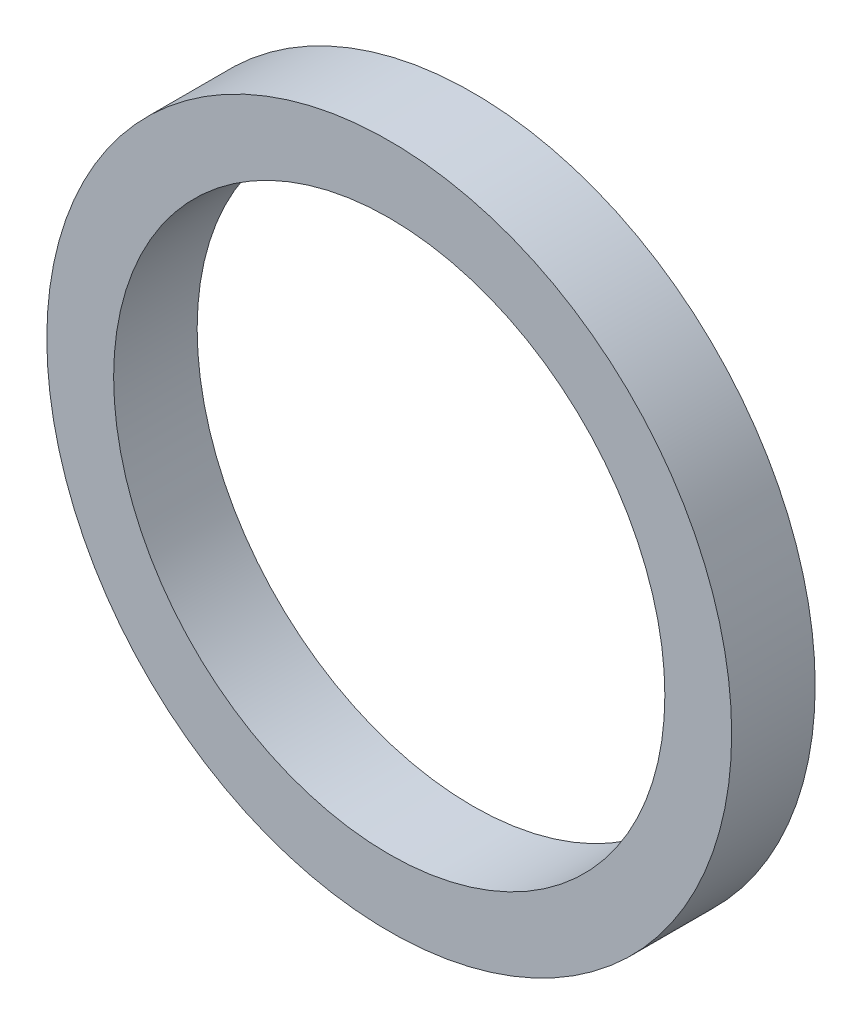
ISO-10303-21;
HEADER;
FILE_DESCRIPTION(('STEP AP214'),'2;1');
FILE_NAME('part.step','',(''),(''),'','','');
FILE_SCHEMA(('AUTOMOTIVE_DESIGN { 1 0 10303 214 1 1 1 1 }'));
ENDSEC;
DATA;
#1=APPLICATION_CONTEXT('core data for automotive mechanical design processes');
#2=APPLICATION_PROTOCOL_DEFINITION('international standard','automotive_design',2000,#1);
#3=PRODUCT_CONTEXT('',#1,'mechanical');
#4=PRODUCT('Part','Part','',(#3));
#5=PRODUCT_RELATED_PRODUCT_CATEGORY('part','',(#4));
#6=PRODUCT_DEFINITION_FORMATION('','',#4);
#7=PRODUCT_DEFINITION_CONTEXT('part definition',#1,'design');
#8=PRODUCT_DEFINITION('design','',#6,#7);
#9=PRODUCT_DEFINITION_SHAPE('','',#8);
#10=(LENGTH_UNIT() NAMED_UNIT(*) SI_UNIT(.MILLI.,.METRE.));
#11=(NAMED_UNIT(*) PLANE_ANGLE_UNIT() SI_UNIT($,.RADIAN.));
#12=(NAMED_UNIT(*) SI_UNIT($,.STERADIAN.) SOLID_ANGLE_UNIT());
#13=UNCERTAINTY_MEASURE_WITH_UNIT(LENGTH_MEASURE(1.E-05),#10,'distance_accuracy_value','');
#14=(GEOMETRIC_REPRESENTATION_CONTEXT(3) GLOBAL_UNCERTAINTY_ASSIGNED_CONTEXT((#13)) GLOBAL_UNIT_ASSIGNED_CONTEXT((#10,
#11,#12)) REPRESENTATION_CONTEXT('',''));
#15=CARTESIAN_POINT('',(0.,0.,0.));
#16=DIRECTION('',(0.,0.,1.));
#17=DIRECTION('',(1.,0.,0.));
#18=AXIS2_PLACEMENT_3D('',#15,#16,#17);
#19=CARTESIAN_POINT('',(0.,0.,2.5));
#20=DIRECTION('',(0.,0.,1.));
#21=DIRECTION('',(1.,0.,0.));
#22=AXIS2_PLACEMENT_3D('',#19,#20,#21);
#23=PLANE('',#22);
#24=CARTESIAN_POINT('',(0.,0.,2.5));
#25=DIRECTION('',(0.,0.,1.));
#26=DIRECTION('',(1.,0.,0.));
#27=AXIS2_PLACEMENT_3D('',#24,#25,#26);
#28=CIRCLE('',#27,10.25);
#29=CARTESIAN_POINT('',(10.25,0.,2.5));
#30=VERTEX_POINT('',#29);
#31=EDGE_CURVE('E10',#30,#30,#28,.T.);
#32=ORIENTED_EDGE('',*,*,#31,.T.);
#33=EDGE_LOOP('',(#32));
#34=FACE_BOUND('',#33,.T.);
#35=CARTESIAN_POINT('',(0.,0.,2.5));
#36=DIRECTION('',(0.,0.,1.));
#37=DIRECTION('',(1.,0.,0.));
#38=AXIS2_PLACEMENT_3D('',#35,#36,#37);
#39=CIRCLE('',#38,8.25);
#40=CARTESIAN_POINT('',(8.25,0.,2.5));
#41=VERTEX_POINT('',#40);
#42=EDGE_CURVE('E48',#41,#41,#39,.T.);
#43=ORIENTED_EDGE('',*,*,#42,.F.);
#44=EDGE_LOOP('',(#43));
#45=FACE_BOUND('',#44,.T.);
#46=ADVANCED_FACE('F34',(#34,#45),#23,.T.);
#47=CARTESIAN_POINT('',(0.,0.,0.));
#48=DIRECTION('',(0.,0.,1.));
#49=DIRECTION('',(1.,0.,0.));
#50=AXIS2_PLACEMENT_3D('',#47,#48,#49);
#51=PLANE('',#50);
#52=CARTESIAN_POINT('',(0.,0.,0.));
#53=DIRECTION('',(0.,0.,1.));
#54=DIRECTION('',(1.,0.,0.));
#55=AXIS2_PLACEMENT_3D('',#52,#53,#54);
#56=CIRCLE('',#55,10.25);
#57=CARTESIAN_POINT('',(10.25,0.,0.));
#58=VERTEX_POINT('',#57);
#59=EDGE_CURVE('E38',#58,#58,#56,.T.);
#60=ORIENTED_EDGE('',*,*,#59,.F.);
#61=EDGE_LOOP('',(#60));
#62=FACE_BOUND('',#61,.T.);
#63=CARTESIAN_POINT('',(0.,0.,0.));
#64=DIRECTION('',(0.,0.,1.));
#65=DIRECTION('',(1.,0.,0.));
#66=AXIS2_PLACEMENT_3D('',#63,#64,#65);
#67=CIRCLE('',#66,8.25);
#68=CARTESIAN_POINT('',(8.25,0.,0.));
#69=VERTEX_POINT('',#68);
#70=EDGE_CURVE('E50',#69,#69,#67,.T.);
#71=ORIENTED_EDGE('',*,*,#70,.T.);
#72=EDGE_LOOP('',(#71));
#73=FACE_BOUND('',#72,.T.);
#74=ADVANCED_FACE('F63',(#62,#73),#51,.F.);
#75=CARTESIAN_POINT('',(0.,0.,2.5));
#76=DIRECTION('',(0.,0.,-1.));
#77=DIRECTION('',(-1.,0.,0.));
#78=AXIS2_PLACEMENT_3D('',#75,#76,#77);
#79=CYLINDRICAL_SURFACE('',#78,10.25);
#80=ORIENTED_EDGE('',*,*,#31,.F.);
#81=EDGE_LOOP('',(#80));
#82=FACE_BOUND('',#81,.T.);
#83=ORIENTED_EDGE('',*,*,#59,.T.);
#84=EDGE_LOOP('',(#83));
#85=FACE_BOUND('',#84,.T.);
#86=ADVANCED_FACE('F36',(#82,#85),#79,.T.);
#87=CARTESIAN_POINT('',(0.,0.,2.5));
#88=DIRECTION('',(0.,0.,-1.));
#89=DIRECTION('',(-1.,0.,0.));
#90=AXIS2_PLACEMENT_3D('',#87,#88,#89);
#91=CYLINDRICAL_SURFACE('',#90,8.25);
#92=ORIENTED_EDGE('',*,*,#42,.T.);
#93=EDGE_LOOP('',(#92));
#94=FACE_BOUND('',#93,.T.);
#95=ORIENTED_EDGE('',*,*,#70,.F.);
#96=EDGE_LOOP('',(#95));
#97=FACE_BOUND('',#96,.T.);
#98=ADVANCED_FACE('F59',(#94,#97),#91,.F.);
#99=CLOSED_SHELL('',(#46,#74,#86,#98));
#100=MANIFOLD_SOLID_BREP('B2',#99);
#101=ADVANCED_BREP_SHAPE_REPRESENTATION('',(#18,#100),#14);
#102=SHAPE_DEFINITION_REPRESENTATION(#9,#101);
ENDSEC;
END-ISO-10303-21;
